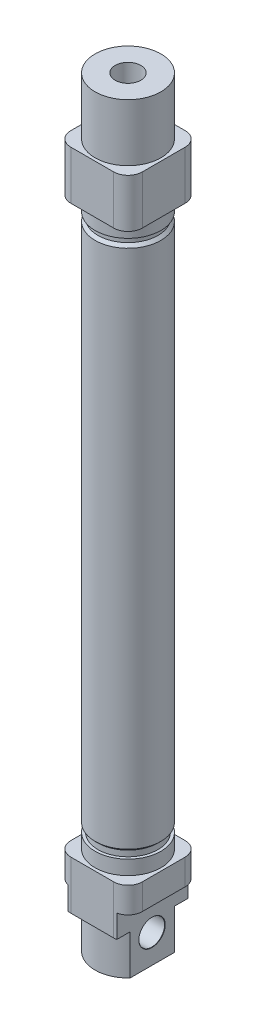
from build123d import *

# Parameters (mm, degrees)
ESQUISSE2_W                  = 25
ESQUISSE2_H                  = 25
EXTRUSION1_DEPTH             = 17
ESQUISSE3_W                  = 25
ESQUISSE3_H                  = 25
EXTRUSION2_DEPTH             = 17
ESQUISSE4_R                  = 11.5
EXTRUSION3_DEPTH             = 20
EXTRUSION4_START             = 14
ESQUISSE5_R                  = 11.5
EXTRUSION4_DEPTH             = 14
CONG_1_R                     = 5
ESQUISSE6_W                  = 6.111111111
ESQUISSE6_H                  = 26.703703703
ESQUISSE6_W_2                = 5.518518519
ESQUISSE6_H_2                = 27.037037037
ENL_V_MAT_EXTRU_1_DEPTH      = 22
ESQUISSE7_R                  = 4.5
ENL_V_MAT_EXTRU_2_DEPTH      = 237.267327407
CHANFREIN1_SIZE              = 0.1
TROU_TARAUD_M121_D           = 10.2
TROU_TARAUD_M121_DEPTH       = 20
TROU_TARAUD_M121_TIP         = 3.064389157
TROU_TARAUD_M122_D           = 10.2
TROU_TARAUD_M122_DEPTH       = 20
TROU_TARAUD_M122_TIP         = 3.064389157
ESQUISSE12_R                 = 4.5
ENL_V_MAT_EXTRU_3_DEPTH      = 45
ESQUISSE13_R                 = 5.5
ENL_V_MAT_EXTRU_4_DEPTH      = 170
ENL_V_MAT_EXTRU_5_REACH      = 217.726
ENL_V_MAT_EXTRU_5_END_RADIUS = 5.1
ESQUISSE14_R                 = 0.5


with BuildPart() as part:
    # Esquisse1 → R_volution1 (revolve)
    with BuildSketch(Plane.XY, mode=Mode.PRIVATE) as r_volution1_sk:
        Polygon((11.5, 190), (11.5, 8), (10.5, 7), (10.5, 5), (11.5, 5), (11.5, 0), (0, 0), (0, 198), (11.5, 198), (11.5, 193), (10.5, 193), (10.5, 191), align=None)
    revolve(r_volution1_sk.sketch.rotate(Axis((0, 551.092499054, 0), (0, -1, 0)), 90), axis=Axis((0, 551.092499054, 0), (0, -1, 0)))

    # Esquisse2 → Extrusion1 (add)
    with BuildSketch(Plane(origin=(0, 198, 0), x_dir=(1, 0, 0), z_dir=(0, 1, 0))):
        Rectangle(ESQUISSE2_W, ESQUISSE2_H)
    extrude(amount=EXTRUSION1_DEPTH)

    # Esquisse3 → Extrusion2 (add)
    with BuildSketch(Plane.XZ):
        Rectangle(ESQUISSE3_W, ESQUISSE3_H)
    extrude(amount=EXTRUSION2_DEPTH)

    # Esquisse4 → Extrusion3 (add)
    with BuildSketch(Plane(origin=(0, 215, 0), x_dir=(1, 0, 0), z_dir=(0, 1, 0))):
        with Locations(Location((0, 0, 0), (0, 0, 270))):
            Circle(ESQUISSE4_R)
    extrude(amount=EXTRUSION3_DEPTH)

    # Esquisse5 → Extrusion4 (add)
    with BuildSketch(Plane.XZ.offset(17).offset(EXTRUSION4_START)):
        with Locations(Location((0, 0, 0), (0, 0, 90))):
            Circle(ESQUISSE5_R)
    extrude(amount=-EXTRUSION4_DEPTH)

    # Cong_1
    cong_1_edges = [part.edges().sort_by_distance(p)[0] for p in [
        (12.5, 206.5, 12.5),
        (12.5, 206.5, -12.5),
        (-12.5, 206.5, -12.5),
        (-12.5, 206.5, 12.5),
        (-12.5, -8.5, 12.5),
        (-12.5, -8.5, -12.5),
        (12.5, -8.5, -12.5),
        (12.5, -8.5, 12.5),
    ]]
    fillet(cong_1_edges, radius=CONG_1_R)

    # Esquisse6 → Enl_v. mat.-Extru.1 (cut)
    with BuildSketch(Plane.XZ.offset(31)):
        with Locations((11.555555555, 0.092592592)):
            Rectangle(ESQUISSE6_W, ESQUISSE6_H)
        with Locations((-11.25925926, -0.074074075)):
            Rectangle(ESQUISSE6_W_2, ESQUISSE6_H_2)
    extrude(amount=-ENL_V_MAT_EXTRU_1_DEPTH, mode=Mode.SUBTRACT)

    # Esquisse7 → Enl_v. mat.-Extru.2 (cut, through all)
    with BuildSketch(Plane(origin=(8.5, 0, 0), x_dir=(0, 0, -1), z_dir=(1, 0, 0))):
        with Locations((-0.101020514, -21)):
            Circle(ESQUISSE7_R)
    extrude(amount=-ENL_V_MAT_EXTRU_2_DEPTH, mode=Mode.SUBTRACT)

    # Chanfrein1
    chanfrein1_edges = [part.edges().sort_by_distance(p)[0] for p in [
        (-8.5, -21, 4.601020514),
        (8.5, -21, 4.601020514),
    ]]
    chamfer(chanfrein1_edges, length=CHANFREIN1_SIZE)

    # Trou taraud_ M121
    with Locations(Plane(origin=(0, 0, -12.5), x_dir=(-1, 0, 0), z_dir=(0, 0, -1))):
        with Locations((0, -9)):
            Hole(TROU_TARAUD_M121_D / 2, depth=TROU_TARAUD_M121_DEPTH)
            with Locations((0, 0, -(TROU_TARAUD_M121_DEPTH + TROU_TARAUD_M121_TIP / 2))):  # 118° drill point
                Cone(0, TROU_TARAUD_M121_D / 2, TROU_TARAUD_M121_TIP, mode=Mode.SUBTRACT)

    # Trou taraud_ M122
    with Locations(Plane(origin=(0, 0, -12.5), x_dir=(-1, 0, 0), z_dir=(0, 0, -1))):
        with Locations((0, 206)):
            Hole(TROU_TARAUD_M122_D / 2, depth=TROU_TARAUD_M122_DEPTH)
            with Locations((0, 0, -(TROU_TARAUD_M122_DEPTH + TROU_TARAUD_M122_TIP / 2))):  # 118° drill point
                Cone(0, TROU_TARAUD_M122_D / 2, TROU_TARAUD_M122_TIP, mode=Mode.SUBTRACT)

    # Esquisse12 → Enl_v. mat.-Extru.3 (cut)
    with BuildSketch(Plane(origin=(0, 235, 0), x_dir=(1, 0, 0), z_dir=(0, 1, 0))):
        with Locations(Location((0, 0, 0), (0, 0, 270))):
            Circle(ESQUISSE12_R)
    extrude(amount=-ENL_V_MAT_EXTRU_3_DEPTH, mode=Mode.SUBTRACT)

    # Esquisse13 → Enl_v. mat.-Extru.4 (cut)
    with BuildSketch(Plane(origin=(0, 190, 0), x_dir=(1, 0, 0), z_dir=(0, 1, 0))):
        with Locations(Location((0, 0, 0), (0, 0, 270))):
            Circle(ESQUISSE13_R)
    extrude(amount=-ENL_V_MAT_EXTRU_4_DEPTH, mode=Mode.SUBTRACT)

    # Enl_v. mat.-Extru.5: up to this cylinder (the profile starts outside it)
    enl_v_mat_extru_5_end = Plane(origin=(0, -9, 0), z_dir=(0, 0, -1)) * Cylinder(ENL_V_MAT_EXTRU_5_END_RADIUS, 446.652, mode=Mode.PRIVATE)
    # Esquisse14 → Enl_v. mat.-Extru.5 (cut, up to the surface)
    with BuildSketch(Plane(origin=(0, 20, 0), x_dir=(1, 0, 0), z_dir=(0, 1, 0)), mode=Mode.PRIVATE) as enl_v_mat_extru_5_sk1:
        with Locations(Location((0, 0, 0), (0, 0, 270))):
            Circle(ESQUISSE14_R)
    enl_v_mat_extru_5_tool1 = extrude(enl_v_mat_extru_5_sk1.sketch, amount=-ENL_V_MAT_EXTRU_5_REACH, mode=Mode.PRIVATE) - enl_v_mat_extru_5_end
    add(enl_v_mat_extru_5_tool1.solids().sort_by_distance((0, 20, 0))[0], mode=Mode.SUBTRACT)


solid = part.part
